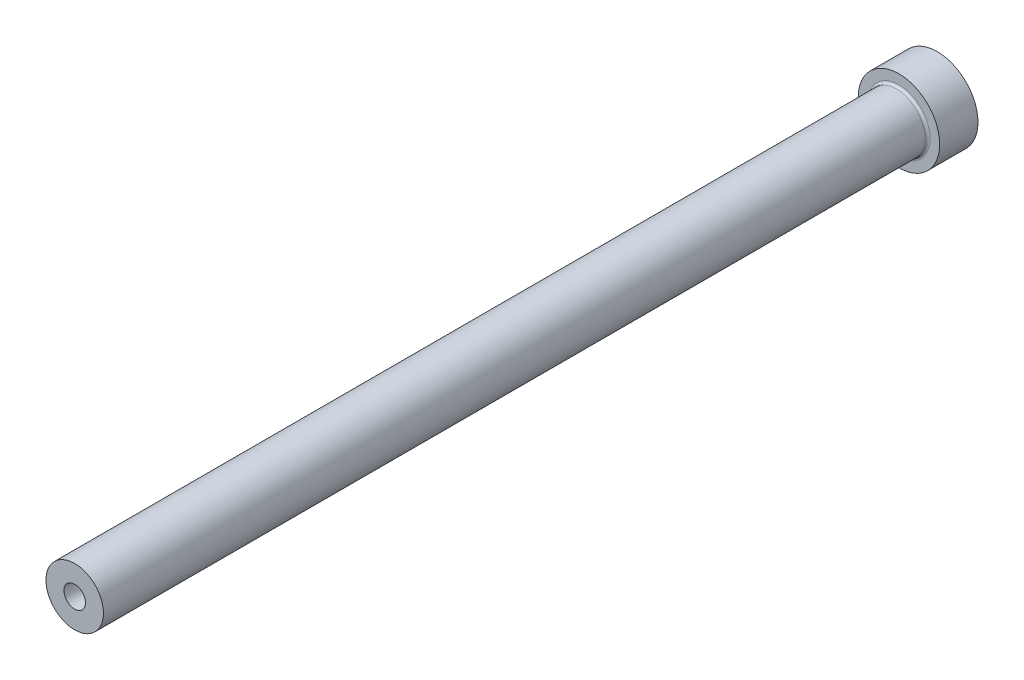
from build123d import *

# Parameters (mm, degrees)
HEAD_FILLET_R          = 0.5
ID_RELIEF_CHAMFER_SIZE = 0.5


with BuildPart() as part:
    # OD FV → Base Revolve (revolve)
    with BuildSketch(Plane(origin=(0, 0, 0), x_dir=(1, 0, 0), z_dir=(0, 1, 0))):
        Polygon((0, -180), (6, -180), (6, -8), (8.5, -8), (8.5, 0), (0, 0), align=None)
    revolve(axis=Axis((0, 0, 180), (0, 0, -1)))

    # ID FV → Hole (revolve, cut)
    with BuildSketch(Plane(origin=(0, 0, 0), x_dir=(1, 0, 0), z_dir=(0, 1, 0))):
        Polygon((0, -180), (2.25, -180), (2.25, -105), (2.5, -104.566987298), (2.5, 0), (0, 0), align=None)
    revolve(axis=Axis((0, 0, 180), (0, 0, -1)), mode=Mode.SUBTRACT)

    # Head Fillet
    head_fillet_edges = [part.edges().sort_by_distance(p)[0] for p in [
        (-6, 0, 8),
    ]]
    fillet(head_fillet_edges, radius=HEAD_FILLET_R)

    # ID Relief Chamfer
    id_relief_chamfer_edges = [part.edges().sort_by_distance(p)[0] for p in [
        (-2.5, 0, 0),
    ]]
    chamfer(id_relief_chamfer_edges, length=ID_RELIEF_CHAMFER_SIZE)


solid = part.part
